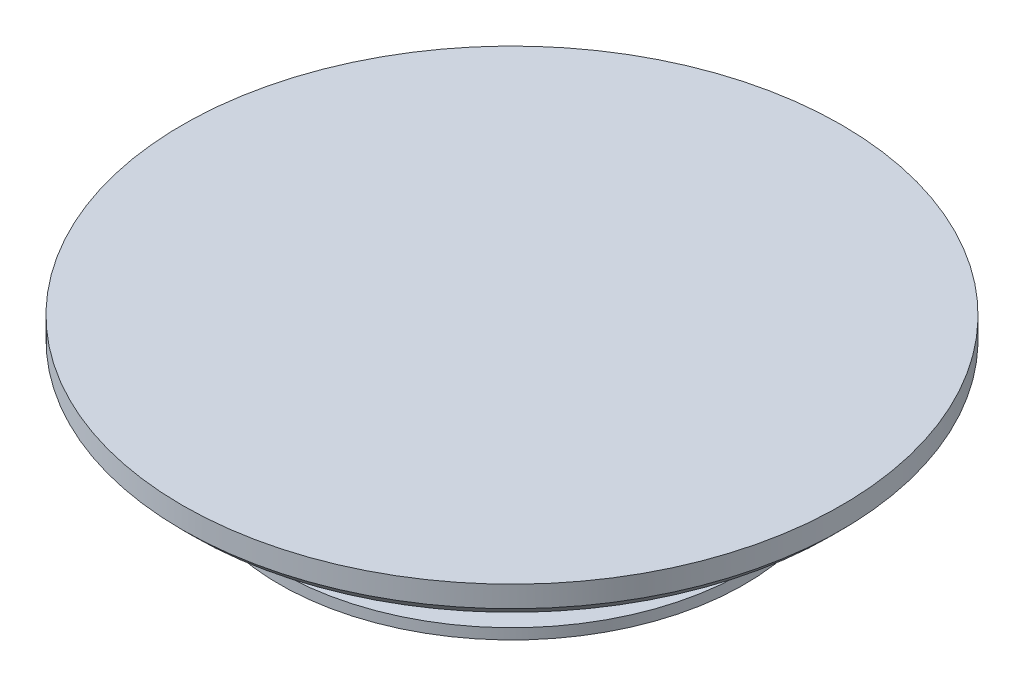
from build123d import *


with BuildPart() as part:
    # Sketch1 → Revolve1 (revolve)
    with BuildSketch(Plane.XY, mode=Mode.PRIVATE) as revolve1_sk:
        Polygon((15.5, 4.5), (15.5, 5.5), (0, 5.5), (0, 0), (10.936902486, 0), (10.936902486, 0.5), (9.936902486, 0.5), (12, 4), (15, 4), align=None)
    revolve(revolve1_sk.sketch.rotate(Axis((0, 0, 0), (0, 1, 0)), 90), axis=Axis((0, 0, 0), (0, 1, 0)))


solid = part.part
